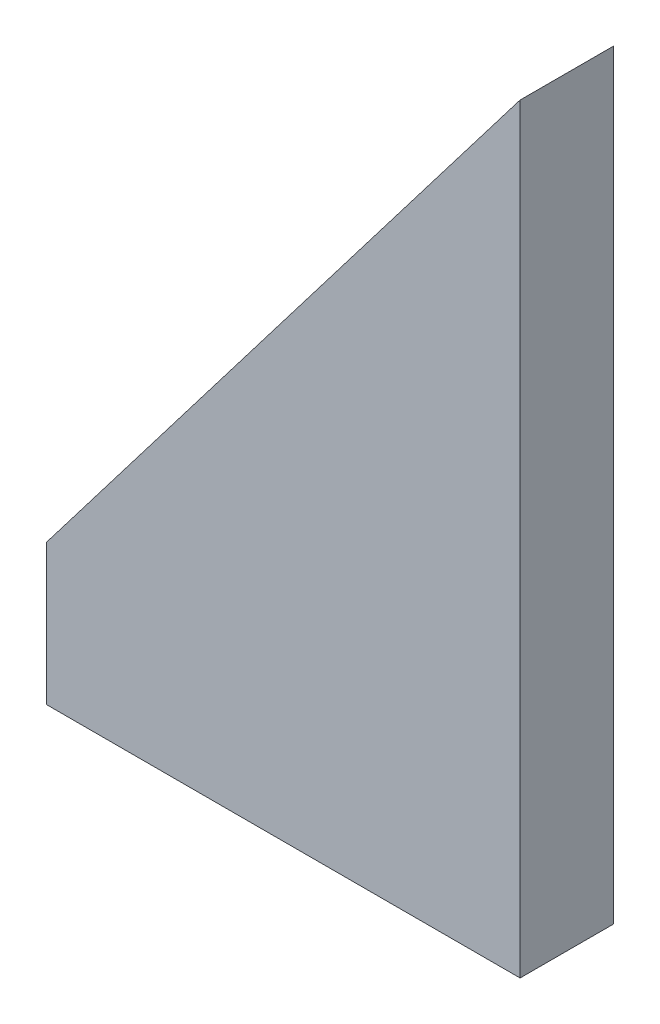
from build123d import *

# Parameters (mm, degrees)
EXTRUSION1_DEPTH = 8


with BuildPart() as part:
    # Esquisse1 → Extrusion1 (new body)
    with BuildSketch(Plane.XY):
        Polygon((0, 0), (0, 12), (40.5, 65), (40.5, 0), align=None)
    extrude(amount=EXTRUSION1_DEPTH)


solid = part.part
